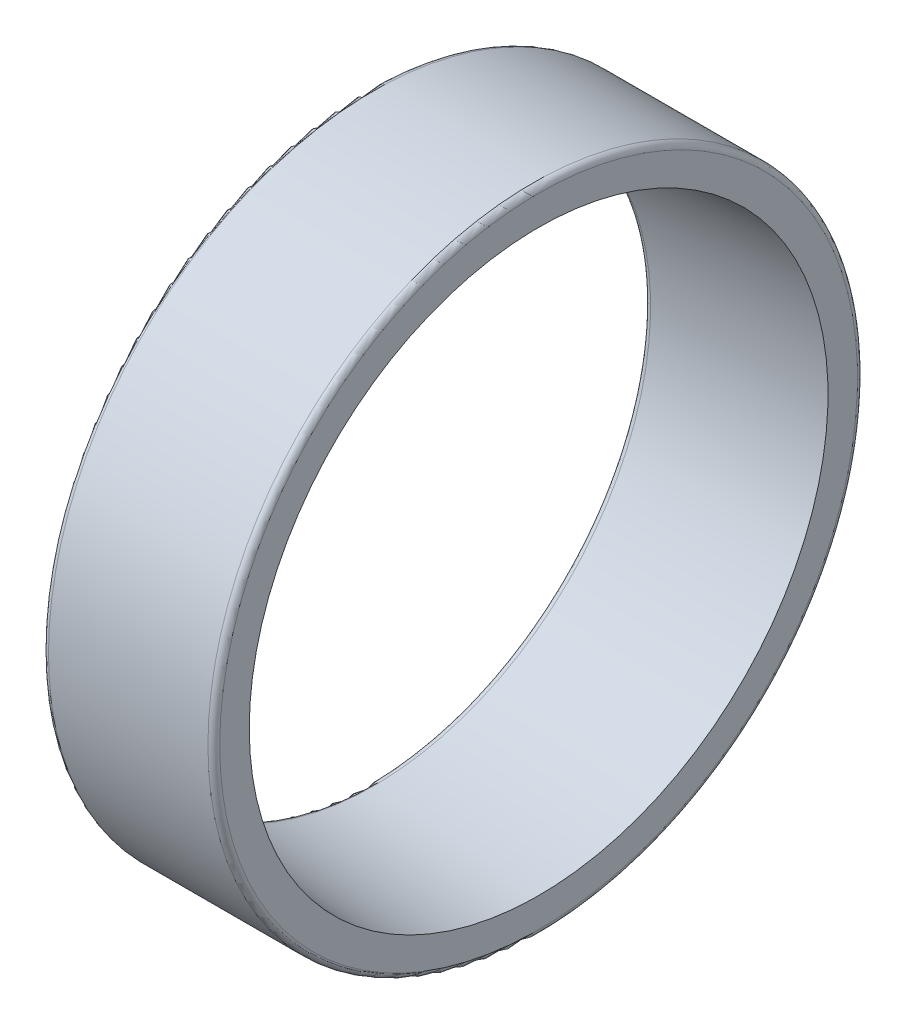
ISO-10303-21;
HEADER;
FILE_DESCRIPTION(('STEP AP214'),'2;1');
FILE_NAME('part.step','',(''),(''),'','','');
FILE_SCHEMA(('AUTOMOTIVE_DESIGN { 1 0 10303 214 1 1 1 1 }'));
ENDSEC;
DATA;
#1=APPLICATION_CONTEXT('core data for automotive mechanical design processes');
#2=APPLICATION_PROTOCOL_DEFINITION('international standard','automotive_design',2000,#1);
#3=PRODUCT_CONTEXT('',#1,'mechanical');
#4=PRODUCT('Part','Part','',(#3));
#5=PRODUCT_RELATED_PRODUCT_CATEGORY('part','',(#4));
#6=PRODUCT_DEFINITION_FORMATION('','',#4);
#7=PRODUCT_DEFINITION_CONTEXT('part definition',#1,'design');
#8=PRODUCT_DEFINITION('design','',#6,#7);
#9=PRODUCT_DEFINITION_SHAPE('','',#8);
#10=(LENGTH_UNIT() NAMED_UNIT(*) SI_UNIT(.MILLI.,.METRE.));
#11=(NAMED_UNIT(*) PLANE_ANGLE_UNIT() SI_UNIT($,.RADIAN.));
#12=(NAMED_UNIT(*) SI_UNIT($,.STERADIAN.) SOLID_ANGLE_UNIT());
#13=UNCERTAINTY_MEASURE_WITH_UNIT(LENGTH_MEASURE(1.E-05),#10,'distance_accuracy_value','');
#14=(GEOMETRIC_REPRESENTATION_CONTEXT(3) GLOBAL_UNCERTAINTY_ASSIGNED_CONTEXT((#13)) GLOBAL_UNIT_ASSIGNED_CONTEXT((#10,
#11,#12)) REPRESENTATION_CONTEXT('',''));
#15=CARTESIAN_POINT('',(0.,0.,0.));
#16=DIRECTION('',(0.,0.,1.));
#17=DIRECTION('',(1.,0.,0.));
#18=AXIS2_PLACEMENT_3D('',#15,#16,#17);
#19=CARTESIAN_POINT('',(1.,0.,0.));
#20=DIRECTION('',(-1.,0.,0.));
#21=DIRECTION('',(0.,0.,1.));
#22=AXIS2_PLACEMENT_3D('',#19,#20,#21);
#23=TOROIDAL_SURFACE('',#22,47.8764810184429,0.999999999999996);
#24=CARTESIAN_POINT('',(1.07581213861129,0.,0.));
#25=DIRECTION('',(-1.,0.,0.));
#26=DIRECTION('',(0.,0.,1.));
#27=AXIS2_PLACEMENT_3D('',#24,#25,#26);
#28=CIRCLE('',#27,46.8793588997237);
#29=CARTESIAN_POINT('',(1.07581213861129,0.,46.8793588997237));
#30=VERTEX_POINT('',#29);
#31=EDGE_CURVE('E10',#30,#30,#28,.T.);
#32=ORIENTED_EDGE('',*,*,#31,.F.);
#33=EDGE_LOOP('',(#32));
#34=FACE_BOUND('',#33,.T.);
#35=CARTESIAN_POINT('',(0.,0.,0.));
#36=DIRECTION('',(-1.,0.,0.));
#37=DIRECTION('',(0.,0.,1.));
#38=AXIS2_PLACEMENT_3D('',#35,#36,#37);
#39=CIRCLE('',#38,47.8764810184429);
#40=CARTESIAN_POINT('',(0.,0.,47.8764810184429));
#41=VERTEX_POINT('',#40);
#42=EDGE_CURVE('E54',#41,#41,#39,.T.);
#43=ORIENTED_EDGE('',*,*,#42,.T.);
#44=EDGE_LOOP('',(#43));
#45=FACE_BOUND('',#44,.T.);
#46=ADVANCED_FACE('F29',(#34,#45),#23,.T.);
#47=CARTESIAN_POINT('',(28.7059637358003,0.,0.));
#48=DIRECTION('',(1.,0.,0.));
#49=DIRECTION('',(0.,0.,-1.));
#50=AXIS2_PLACEMENT_3D('',#47,#48,#49);
#51=CONICAL_SURFACE('',#50,48.9801054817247,0.0758849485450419);
#52=CARTESIAN_POINT('',(29.,0.,0.));
#53=DIRECTION('',(-1.,0.,0.));
#54=DIRECTION('',(0.,0.,1.));
#55=AXIS2_PLACEMENT_3D('',#52,#53,#54);
#56=CIRCLE('',#55,49.0024613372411);
#57=CARTESIAN_POINT('',(29.,0.,49.0024613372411));
#58=VERTEX_POINT('',#57);
#59=EDGE_CURVE('E35',#58,#58,#56,.T.);
#60=ORIENTED_EDGE('',*,*,#59,.F.);
#61=EDGE_LOOP('',(#60));
#62=FACE_BOUND('',#61,.T.);
#63=ORIENTED_EDGE('',*,*,#31,.T.);
#64=EDGE_LOOP('',(#63));
#65=FACE_BOUND('',#64,.T.);
#66=ADVANCED_FACE('F85',(#62,#65),#51,.F.);
#67=CARTESIAN_POINT('',(29.,0.,-54.));
#68=DIRECTION('',(-1.,0.,0.));
#69=DIRECTION('',(0.,0.,1.));
#70=AXIS2_PLACEMENT_3D('',#67,#68,#69);
#71=PLANE('',#70);
#72=CARTESIAN_POINT('',(29.,0.,0.));
#73=DIRECTION('',(-1.,0.,0.));
#74=DIRECTION('',(0.,0.,1.));
#75=AXIS2_PLACEMENT_3D('',#72,#73,#74);
#76=CIRCLE('',#75,54.);
#77=CARTESIAN_POINT('',(29.,0.,54.));
#78=VERTEX_POINT('',#77);
#79=EDGE_CURVE('E39',#78,#78,#76,.T.);
#80=ORIENTED_EDGE('',*,*,#79,.F.);
#81=EDGE_LOOP('',(#80));
#82=FACE_BOUND('',#81,.T.);
#83=ORIENTED_EDGE('',*,*,#59,.T.);
#84=EDGE_LOOP('',(#83));
#85=FACE_BOUND('',#84,.T.);
#86=ADVANCED_FACE('F80',(#82,#85),#71,.F.);
#87=CARTESIAN_POINT('',(28.,0.,0.));
#88=DIRECTION('',(-1.,0.,0.));
#89=DIRECTION('',(0.,0.,1.));
#90=AXIS2_PLACEMENT_3D('',#87,#88,#89);
#91=TOROIDAL_SURFACE('',#90,54.,1.);
#92=CARTESIAN_POINT('',(28.,0.,0.));
#93=DIRECTION('',(-1.,0.,0.));
#94=DIRECTION('',(0.,0.,1.));
#95=AXIS2_PLACEMENT_3D('',#92,#93,#94);
#96=CIRCLE('',#95,55.);
#97=CARTESIAN_POINT('',(28.,0.,55.));
#98=VERTEX_POINT('',#97);
#99=EDGE_CURVE('E43',#98,#98,#96,.T.);
#100=ORIENTED_EDGE('',*,*,#99,.F.);
#101=EDGE_LOOP('',(#100));
#102=FACE_BOUND('',#101,.T.);
#103=ORIENTED_EDGE('',*,*,#79,.T.);
#104=EDGE_LOOP('',(#103));
#105=FACE_BOUND('',#104,.T.);
#106=ADVANCED_FACE('F74',(#102,#105),#91,.T.);
#107=CARTESIAN_POINT('',(0.,0.,0.));
#108=DIRECTION('',(-1.,0.,0.));
#109=DIRECTION('',(0.,0.,1.));
#110=AXIS2_PLACEMENT_3D('',#107,#108,#109);
#111=CYLINDRICAL_SURFACE('',#110,55.);
#112=CARTESIAN_POINT('',(1.,0.,0.));
#113=DIRECTION('',(-1.,0.,0.));
#114=DIRECTION('',(0.,0.,1.));
#115=AXIS2_PLACEMENT_3D('',#112,#113,#114);
#116=CIRCLE('',#115,55.);
#117=CARTESIAN_POINT('',(1.,0.,55.));
#118=VERTEX_POINT('',#117);
#119=EDGE_CURVE('E48',#118,#118,#116,.T.);
#120=ORIENTED_EDGE('',*,*,#119,.F.);
#121=EDGE_LOOP('',(#120));
#122=FACE_BOUND('',#121,.T.);
#123=ORIENTED_EDGE('',*,*,#99,.T.);
#124=EDGE_LOOP('',(#123));
#125=FACE_BOUND('',#124,.T.);
#126=ADVANCED_FACE('F68',(#122,#125),#111,.T.);
#127=CARTESIAN_POINT('',(1.,0.,0.));
#128=DIRECTION('',(-1.,0.,0.));
#129=DIRECTION('',(0.,0.,1.));
#130=AXIS2_PLACEMENT_3D('',#127,#128,#129);
#131=TOROIDAL_SURFACE('',#130,54.,1.);
#132=CARTESIAN_POINT('',(0.,0.,0.));
#133=DIRECTION('',(-1.,0.,0.));
#134=DIRECTION('',(0.,0.,1.));
#135=AXIS2_PLACEMENT_3D('',#132,#133,#134);
#136=CIRCLE('',#135,54.);
#137=CARTESIAN_POINT('',(0.,0.,54.));
#138=VERTEX_POINT('',#137);
#139=EDGE_CURVE('E51',#138,#138,#136,.T.);
#140=ORIENTED_EDGE('',*,*,#139,.F.);
#141=EDGE_LOOP('',(#140));
#142=FACE_BOUND('',#141,.T.);
#143=ORIENTED_EDGE('',*,*,#119,.T.);
#144=EDGE_LOOP('',(#143));
#145=FACE_BOUND('',#144,.T.);
#146=ADVANCED_FACE('F62',(#142,#145),#131,.T.);
#147=CARTESIAN_POINT('',(0.,0.,-47.8764810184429));
#148=DIRECTION('',(1.,0.,0.));
#149=DIRECTION('',(0.,0.,-1.));
#150=AXIS2_PLACEMENT_3D('',#147,#148,#149);
#151=PLANE('',#150);
#152=ORIENTED_EDGE('',*,*,#42,.F.);
#153=EDGE_LOOP('',(#152));
#154=FACE_BOUND('',#153,.T.);
#155=ORIENTED_EDGE('',*,*,#139,.T.);
#156=EDGE_LOOP('',(#155));
#157=FACE_BOUND('',#156,.T.);
#158=ADVANCED_FACE('F59',(#154,#157),#151,.F.);
#159=CLOSED_SHELL('',(#46,#66,#86,#106,#126,#146,#158));
#160=MANIFOLD_SOLID_BREP('B2',#159);
#161=ADVANCED_BREP_SHAPE_REPRESENTATION('',(#18,#160),#14);
#162=SHAPE_DEFINITION_REPRESENTATION(#9,#161);
ENDSEC;
END-ISO-10303-21;
